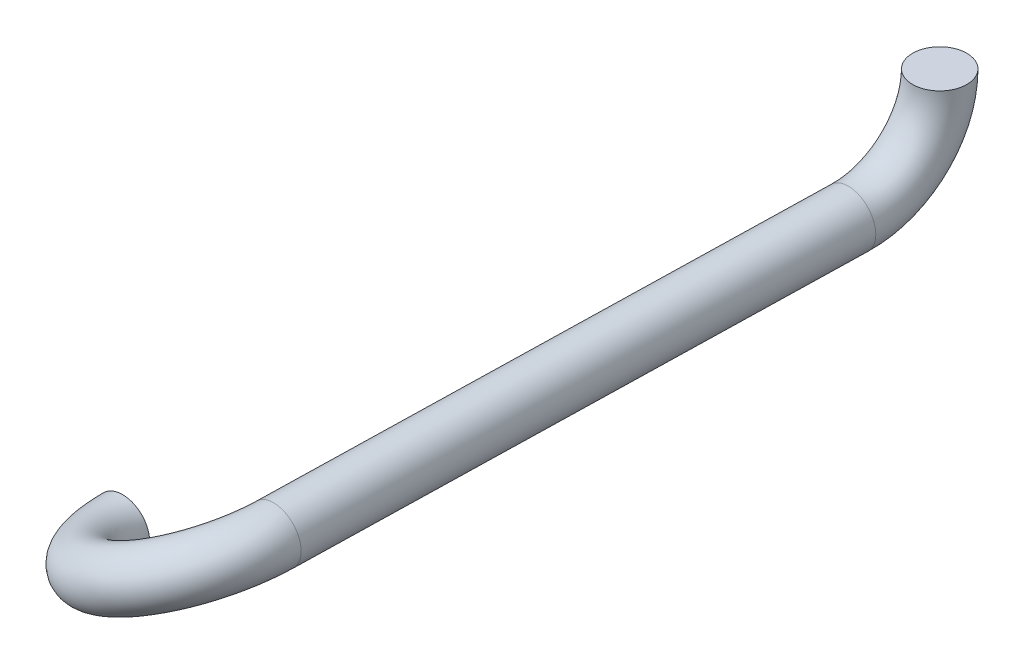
ISO-10303-21;
HEADER;
FILE_DESCRIPTION(('STEP AP214'),'2;1');
FILE_NAME('part.step','',(''),(''),'','','');
FILE_SCHEMA(('AUTOMOTIVE_DESIGN { 1 0 10303 214 1 1 1 1 }'));
ENDSEC;
DATA;
#1=APPLICATION_CONTEXT('core data for automotive mechanical design processes');
#2=APPLICATION_PROTOCOL_DEFINITION('international standard','automotive_design',2000,#1);
#3=PRODUCT_CONTEXT('',#1,'mechanical');
#4=PRODUCT('Part','Part','',(#3));
#5=PRODUCT_RELATED_PRODUCT_CATEGORY('part','',(#4));
#6=PRODUCT_DEFINITION_FORMATION('','',#4);
#7=PRODUCT_DEFINITION_CONTEXT('part definition',#1,'design');
#8=PRODUCT_DEFINITION('design','',#6,#7);
#9=PRODUCT_DEFINITION_SHAPE('','',#8);
#10=(LENGTH_UNIT() NAMED_UNIT(*) SI_UNIT(.MILLI.,.METRE.));
#11=(NAMED_UNIT(*) PLANE_ANGLE_UNIT() SI_UNIT($,.RADIAN.));
#12=(NAMED_UNIT(*) SI_UNIT($,.STERADIAN.) SOLID_ANGLE_UNIT());
#13=UNCERTAINTY_MEASURE_WITH_UNIT(LENGTH_MEASURE(1.E-05),#10,'distance_accuracy_value','');
#14=(GEOMETRIC_REPRESENTATION_CONTEXT(3) GLOBAL_UNCERTAINTY_ASSIGNED_CONTEXT((#13)) GLOBAL_UNIT_ASSIGNED_CONTEXT((#10,
#11,#12)) REPRESENTATION_CONTEXT('',''));
#15=CARTESIAN_POINT('',(0.,0.,0.));
#16=DIRECTION('',(0.,0.,1.));
#17=DIRECTION('',(1.,0.,0.));
#18=AXIS2_PLACEMENT_3D('',#15,#16,#17);
#19=CARTESIAN_POINT('',(26.5762432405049,25.273,-79.7689385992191));
#20=DIRECTION('',(0.999015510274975,0.,0.0443622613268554));
#21=DIRECTION('',(0.0443622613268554,0.,-0.999015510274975));
#22=AXIS2_PLACEMENT_3D('',#19,#20,#21);
#23=TOROIDAL_SURFACE('',#22,12.8775392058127,3.96875);
#24=CARTESIAN_POINT('',(26.5880584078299,12.3982152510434,-80.0350101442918));
#25=DIRECTION('',(0.0443527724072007,0.0206820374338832,-0.998801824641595));
#26=DIRECTION('',(-0.641803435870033,-0.76558551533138,-0.0443527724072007));
#27=AXIS2_PLACEMENT_3D('',#24,#25,#26);
#28=CIRCLE('',#27,3.96875);
#29=CARTESIAN_POINT('',(26.5916997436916,8.43031415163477,-80.1170111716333));
#30=VERTEX_POINT('',#29);
#31=EDGE_CURVE('E34',#30,#30,#28,.T.);
#32=CARTESIAN_POINT('',(27.14752,25.273,-92.6338));
#33=DIRECTION('',(0.,1.,0.));
#34=DIRECTION('',(-0.608535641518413,0.,-0.79352654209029));
#35=AXIS2_PLACEMENT_3D('',#32,#33,#34);
#36=CIRCLE('',#35,3.96875);
#37=CARTESIAN_POINT('',(27.323582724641,25.273,-96.5986428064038));
#38=VERTEX_POINT('',#37);
#39=EDGE_CURVE('E10',#38,#38,#36,.T.);
#40=CARTESIAN_POINT('',(26.5762432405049,25.273,-79.7689385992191));
#41=DIRECTION('',(0.999015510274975,0.,0.0443622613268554));
#42=DIRECTION('',(0.0443622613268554,0.,-0.999015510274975));
#43=AXIS2_PLACEMENT_3D('',#40,#41,#42);
#44=CIRCLE('',#43,16.8462892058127);
#45=EDGE_CURVE('',#30,#38,#44,.T.);
#46=ORIENTED_EDGE('',*,*,#31,.T.);
#47=ORIENTED_EDGE('',*,*,#39,.F.);
#48=ORIENTED_EDGE('',*,*,#45,.T.);
#49=ORIENTED_EDGE('',*,*,#45,.F.);
#50=EDGE_LOOP('',(#46,#48,#47,#49));
#51=FACE_BOUND('',#50,.T.);
#52=ADVANCED_FACE('F28',(#51),#23,.T.);
#53=CARTESIAN_POINT('',(23.0064266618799,10.7280729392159,0.621510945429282));
#54=DIRECTION('',(0.0443527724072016,0.0206820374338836,-0.998801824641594));
#55=DIRECTION('',(-0.999015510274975,0.,-0.0443622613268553));
#56=AXIS2_PLACEMENT_3D('',#53,#54,#55);
#57=CYLINDRICAL_SURFACE('',#56,3.96875);
#58=CARTESIAN_POINT('',(23.0064266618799,10.7280729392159,0.621510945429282));
#59=DIRECTION('',(0.0443527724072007,0.0206820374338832,-0.998801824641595));
#60=DIRECTION('',(-0.641803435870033,-0.76558551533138,-0.0443527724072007));
#61=AXIS2_PLACEMENT_3D('',#58,#59,#60);
#62=CIRCLE('',#61,3.96875);
#63=CARTESIAN_POINT('',(26.5990259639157,12.4033295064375,0.815733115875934));
#64=VERTEX_POINT('',#63);
#65=EDGE_CURVE('E38',#64,#64,#62,.T.);
#66=ORIENTED_EDGE('',*,*,#65,.T.);
#67=EDGE_LOOP('',(#66));
#68=FACE_BOUND('',#67,.T.);
#69=ORIENTED_EDGE('',*,*,#31,.F.);
#70=EDGE_LOOP('',(#69));
#71=FACE_BOUND('',#70,.T.);
#72=ADVANCED_FACE('F58',(#68,#71),#57,.T.);
#73=CARTESIAN_POINT('',(11.5101088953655,5.36725192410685,0.));
#74=DIRECTION('',(0.422618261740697,-0.906307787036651,0.));
#75=DIRECTION('',(0.906307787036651,0.422618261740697,0.));
#76=AXIS2_PLACEMENT_3D('',#73,#74,#75);
#77=TOROIDAL_SURFACE('',#76,12.7,3.96875);
#78=CARTESIAN_POINT('',(0.,0.,0.));
#79=DIRECTION('',(0.,0.,1.));
#80=DIRECTION('',(1.,0.,0.));
#81=AXIS2_PLACEMENT_3D('',#78,#79,#80);
#82=CIRCLE('',#81,3.96875);
#83=CARTESIAN_POINT('',(-3.59690902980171,-1.67726622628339,0.));
#84=VERTEX_POINT('',#83);
#85=EDGE_CURVE('E42',#84,#84,#82,.T.);
#86=CARTESIAN_POINT('',(11.5101088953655,5.36725192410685,0.));
#87=DIRECTION('',(0.422618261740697,-0.906307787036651,0.));
#88=DIRECTION('',(0.906307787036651,0.422618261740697,0.));
#89=AXIS2_PLACEMENT_3D('',#86,#87,#88);
#90=CIRCLE('',#89,16.66875);
#91=EDGE_CURVE('',#64,#84,#90,.T.);
#92=ORIENTED_EDGE('',*,*,#65,.F.);
#93=ORIENTED_EDGE('',*,*,#85,.T.);
#94=ORIENTED_EDGE('',*,*,#91,.T.);
#95=ORIENTED_EDGE('',*,*,#91,.F.);
#96=EDGE_LOOP('',(#92,#94,#93,#95));
#97=FACE_BOUND('',#96,.T.);
#98=ADVANCED_FACE('F48',(#97),#77,.T.);
#99=CARTESIAN_POINT('',(27.14752,25.273,-92.6338));
#100=DIRECTION('',(0.,1.,0.));
#101=DIRECTION('',(-0.608535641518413,0.,-0.79352654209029));
#102=AXIS2_PLACEMENT_3D('',#99,#100,#101);
#103=PLANE('',#102);
#104=ORIENTED_EDGE('',*,*,#39,.T.);
#105=EDGE_LOOP('',(#104));
#106=FACE_BOUND('',#105,.T.);
#107=ADVANCED_FACE('F52',(#106),#103,.T.);
#108=CARTESIAN_POINT('',(0.,0.,0.));
#109=DIRECTION('',(0.,0.,1.));
#110=DIRECTION('',(1.,0.,0.));
#111=AXIS2_PLACEMENT_3D('',#108,#109,#110);
#112=PLANE('',#111);
#113=ORIENTED_EDGE('',*,*,#85,.F.);
#114=EDGE_LOOP('',(#113));
#115=FACE_BOUND('',#114,.T.);
#116=ADVANCED_FACE('F50',(#115),#112,.F.);
#117=CLOSED_SHELL('',(#52,#72,#98,#107,#116));
#118=MANIFOLD_SOLID_BREP('B2',#117);
#119=ADVANCED_BREP_SHAPE_REPRESENTATION('',(#18,#118),#14);
#120=SHAPE_DEFINITION_REPRESENTATION(#9,#119);
ENDSEC;
END-ISO-10303-21;
